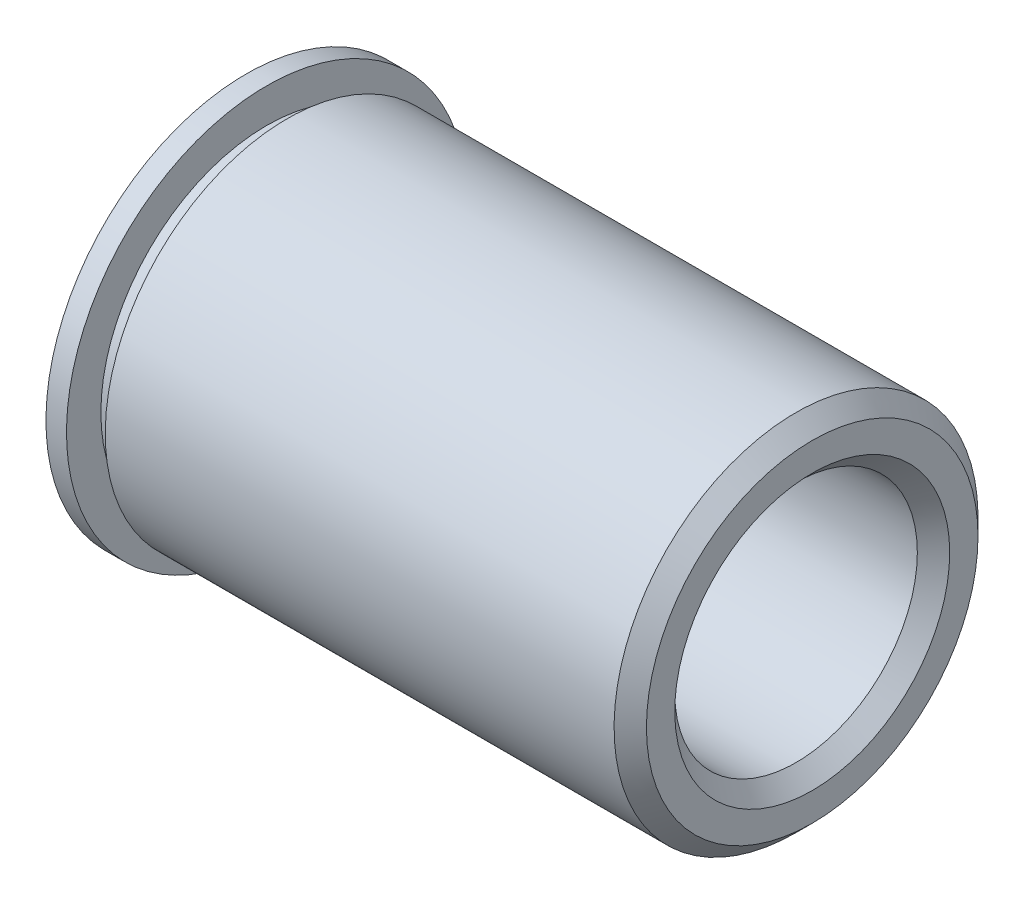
from build123d import *

# Parameters (mm, degrees)
SKETCH2_R          = 1.5
CUT_EXTRUDE1_DEPTH = 8.82631778
CHAMFER1_SIZE      = 0.2
CHAMFER2_SIZE      = 0.2


with BuildPart() as part:
    # Sketch1 → Revolve1 (revolve)
    with BuildSketch(Plane.XY, mode=Mode.PRIVATE) as revolve1_sk:
        Polygon((76.213672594, 0), (76.213672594, 2.25), (69.721672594, 2.25), (69.721672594, 2.05), (69.467672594, 2.05), (69.467672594, 2.475), (69.213672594, 2.475), (69.213672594, 0), align=None)
    revolve(revolve1_sk.sketch.rotate(Axis((-67.824902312, 0, 0), (1, 0, 0)), 180), axis=Axis((-67.824902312, 0, 0), (1, 0, 0)))

    # Sketch2 → Cut-Extrude1 (cut, through all)
    with BuildSketch(Plane(origin=(76.213672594, 0, 0), x_dir=(0, 0, -1), z_dir=(1, 0, 0))):
        Circle(SKETCH2_R)
    extrude(amount=-CUT_EXTRUDE1_DEPTH, mode=Mode.SUBTRACT)

    # Chamfer1
    chamfer1_edges = [part.edges().sort_by_distance(p)[0] for p in [
        (76.213672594, 2.25, 0),
    ]]
    chamfer(chamfer1_edges, length=CHAMFER1_SIZE)

    # Chamfer2
    chamfer2_edges = [part.edges().sort_by_distance(p)[0] for p in [
        (69.213672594, 0, 1.5),
        (76.213672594, 0, 1.5),
    ]]
    chamfer(chamfer2_edges, length=CHAMFER2_SIZE)


solid = part.part
